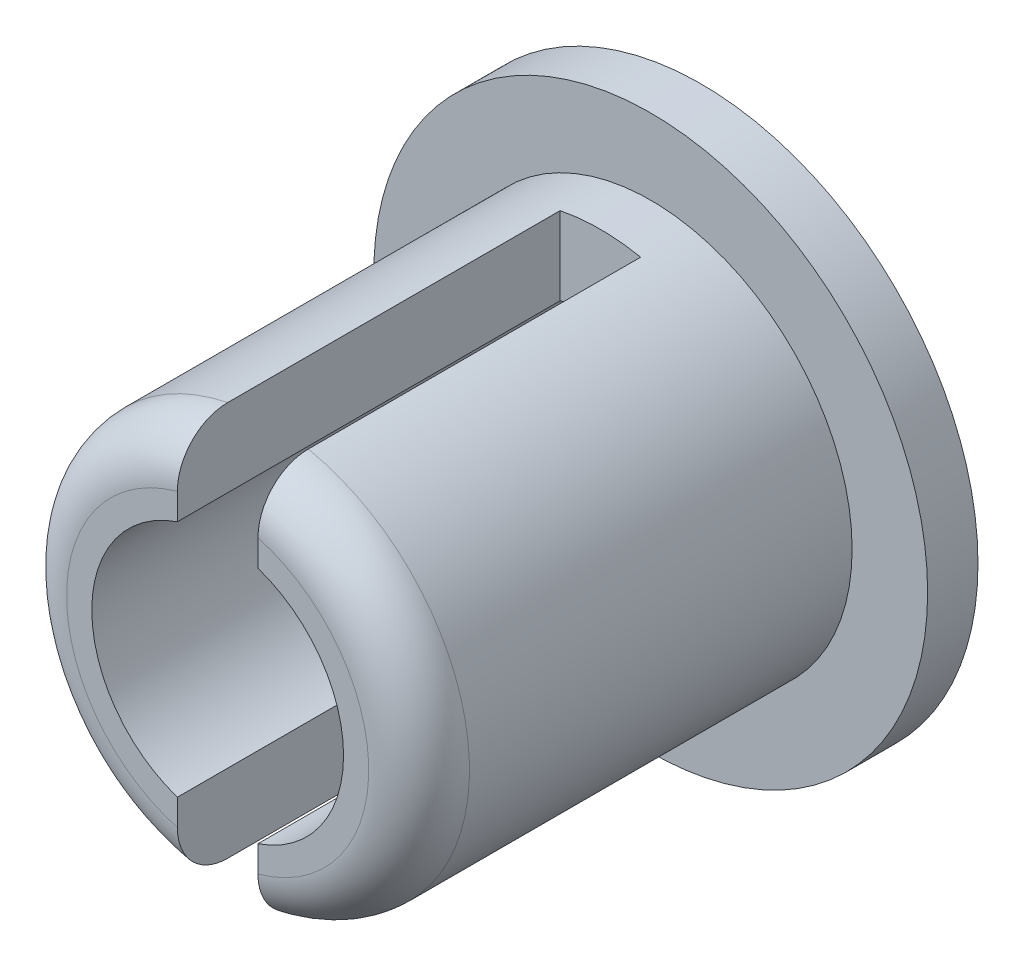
ISO-10303-21;
HEADER;
FILE_DESCRIPTION(('STEP AP214'),'2;1');
FILE_NAME('part.step','',(''),(''),'','','');
FILE_SCHEMA(('AUTOMOTIVE_DESIGN { 1 0 10303 214 1 1 1 1 }'));
ENDSEC;
DATA;
#1=APPLICATION_CONTEXT('core data for automotive mechanical design processes');
#2=APPLICATION_PROTOCOL_DEFINITION('international standard','automotive_design',2000,#1);
#3=PRODUCT_CONTEXT('',#1,'mechanical');
#4=PRODUCT('Part','Part','',(#3));
#5=PRODUCT_RELATED_PRODUCT_CATEGORY('part','',(#4));
#6=PRODUCT_DEFINITION_FORMATION('','',#4);
#7=PRODUCT_DEFINITION_CONTEXT('part definition',#1,'design');
#8=PRODUCT_DEFINITION('design','',#6,#7);
#9=PRODUCT_DEFINITION_SHAPE('','',#8);
#10=(LENGTH_UNIT() NAMED_UNIT(*) SI_UNIT(.MILLI.,.METRE.));
#11=(NAMED_UNIT(*) PLANE_ANGLE_UNIT() SI_UNIT($,.RADIAN.));
#12=(NAMED_UNIT(*) SI_UNIT($,.STERADIAN.) SOLID_ANGLE_UNIT());
#13=UNCERTAINTY_MEASURE_WITH_UNIT(LENGTH_MEASURE(1.E-05),#10,'distance_accuracy_value','');
#14=(GEOMETRIC_REPRESENTATION_CONTEXT(3) GLOBAL_UNCERTAINTY_ASSIGNED_CONTEXT((#13)) GLOBAL_UNIT_ASSIGNED_CONTEXT((#10,
#11,#12)) REPRESENTATION_CONTEXT('',''));
#15=CARTESIAN_POINT('',(0.,0.,0.));
#16=DIRECTION('',(0.,0.,1.));
#17=DIRECTION('',(1.,0.,0.));
#18=AXIS2_PLACEMENT_3D('',#15,#16,#17);
#19=CARTESIAN_POINT('',(0.,0.,1.));
#20=DIRECTION('',(0.,0.,1.));
#21=DIRECTION('',(1.,0.,0.));
#22=AXIS2_PLACEMENT_3D('',#19,#20,#21);
#23=PLANE('',#22);
#24=DIRECTION('',(0.,1.,0.));
#25=VECTOR('',#24,1.);
#26=CARTESIAN_POINT('',(0.4,0.,1.));
#27=LINE('',#26,#25);
#28=CARTESIAN_POINT('',(0.4,-1.95959179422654,1.));
#29=VERTEX_POINT('',#28);
#30=CARTESIAN_POINT('',(0.4,-1.1842719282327,1.));
#31=VERTEX_POINT('',#30);
#32=EDGE_CURVE('E161',#29,#31,#27,.T.);
#33=ORIENTED_EDGE('',*,*,#32,.T.);
#34=CARTESIAN_POINT('',(0.,0.,1.));
#35=DIRECTION('',(0.,0.,1.));
#36=DIRECTION('',(1.,0.,0.));
#37=AXIS2_PLACEMENT_3D('',#34,#35,#36);
#38=CIRCLE('',#37,1.25);
#39=CARTESIAN_POINT('',(-0.4,-1.1842719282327,1.));
#40=VERTEX_POINT('',#39);
#41=EDGE_CURVE('E198',#40,#31,#38,.T.);
#42=ORIENTED_EDGE('',*,*,#41,.F.);
#43=DIRECTION('',(0.,1.,0.));
#44=VECTOR('',#43,1.);
#45=CARTESIAN_POINT('',(-0.4,0.,1.));
#46=LINE('',#45,#44);
#47=CARTESIAN_POINT('',(-0.4,-1.95959179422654,1.));
#48=VERTEX_POINT('',#47);
#49=EDGE_CURVE('E171',#48,#40,#46,.T.);
#50=ORIENTED_EDGE('',*,*,#49,.F.);
#51=CARTESIAN_POINT('',(0.,0.,1.));
#52=DIRECTION('',(0.,0.,1.));
#53=DIRECTION('',(1.,0.,0.));
#54=AXIS2_PLACEMENT_3D('',#51,#52,#53);
#55=CIRCLE('',#54,2.);
#56=EDGE_CURVE('E202',#48,#29,#55,.T.);
#57=ORIENTED_EDGE('',*,*,#56,.T.);
#58=EDGE_LOOP('',(#33,#42,#50,#57));
#59=FACE_BOUND('',#58,.T.);
#60=ADVANCED_FACE('F45',(#59),#23,.T.);
#61=CARTESIAN_POINT('',(0.,0.,0.5));
#62=DIRECTION('',(0.,0.,1.));
#63=DIRECTION('',(1.,0.,0.));
#64=AXIS2_PLACEMENT_3D('',#61,#62,#63);
#65=PLANE('',#64);
#66=CARTESIAN_POINT('',(0.,0.,0.5));
#67=DIRECTION('',(0.,0.,1.));
#68=DIRECTION('',(1.,0.,0.));
#69=AXIS2_PLACEMENT_3D('',#66,#67,#68);
#70=CIRCLE('',#69,2.75);
#71=CARTESIAN_POINT('',(2.75,0.,0.5));
#72=VERTEX_POINT('',#71);
#73=EDGE_CURVE('E215',#72,#72,#70,.T.);
#74=ORIENTED_EDGE('',*,*,#73,.T.);
#75=EDGE_LOOP('',(#74));
#76=FACE_BOUND('',#75,.T.);
#77=CARTESIAN_POINT('',(0.,0.,0.5));
#78=DIRECTION('',(0.,0.,1.));
#79=DIRECTION('',(1.,0.,0.));
#80=AXIS2_PLACEMENT_3D('',#77,#78,#79);
#81=CIRCLE('',#80,2.);
#82=CARTESIAN_POINT('',(2.,0.,0.5));
#83=VERTEX_POINT('',#82);
#84=EDGE_CURVE('E201',#83,#83,#81,.T.);
#85=ORIENTED_EDGE('',*,*,#84,.F.);
#86=EDGE_LOOP('',(#85));
#87=FACE_BOUND('',#86,.T.);
#88=ADVANCED_FACE('F279',(#76,#87),#65,.T.);
#89=CARTESIAN_POINT('',(0.,0.,0.));
#90=DIRECTION('',(0.,0.,1.));
#91=DIRECTION('',(1.,0.,0.));
#92=AXIS2_PLACEMENT_3D('',#89,#90,#91);
#93=PLANE('',#92);
#94=CARTESIAN_POINT('',(0.,0.,0.));
#95=DIRECTION('',(0.,0.,1.));
#96=DIRECTION('',(1.,0.,0.));
#97=AXIS2_PLACEMENT_3D('',#94,#95,#96);
#98=CIRCLE('',#97,2.75);
#99=CARTESIAN_POINT('',(2.75,0.,0.));
#100=VERTEX_POINT('',#99);
#101=EDGE_CURVE('E214',#100,#100,#98,.T.);
#102=ORIENTED_EDGE('',*,*,#101,.F.);
#103=EDGE_LOOP('',(#102));
#104=FACE_BOUND('',#103,.T.);
#105=CARTESIAN_POINT('',(0.,0.,0.));
#106=DIRECTION('',(0.,0.,1.));
#107=DIRECTION('',(1.,0.,0.));
#108=AXIS2_PLACEMENT_3D('',#105,#106,#107);
#109=CIRCLE('',#108,1.25);
#110=CARTESIAN_POINT('',(1.25,0.,0.));
#111=VERTEX_POINT('',#110);
#112=EDGE_CURVE('E206',#111,#111,#109,.T.);
#113=ORIENTED_EDGE('',*,*,#112,.T.);
#114=EDGE_LOOP('',(#113));
#115=FACE_BOUND('',#114,.T.);
#116=ADVANCED_FACE('F281',(#104,#115),#93,.F.);
#117=CARTESIAN_POINT('',(0.,0.,0.5));
#118=DIRECTION('',(0.,0.,-1.));
#119=DIRECTION('',(-1.,0.,0.));
#120=AXIS2_PLACEMENT_3D('',#117,#118,#119);
#121=CYLINDRICAL_SURFACE('',#120,2.75);
#122=ORIENTED_EDGE('',*,*,#73,.F.);
#123=EDGE_LOOP('',(#122));
#124=FACE_BOUND('',#123,.T.);
#125=ORIENTED_EDGE('',*,*,#101,.T.);
#126=EDGE_LOOP('',(#125));
#127=FACE_BOUND('',#126,.T.);
#128=ADVANCED_FACE('F242',(#124,#127),#121,.T.);
#129=CARTESIAN_POINT('',(0.,0.,0.5));
#130=DIRECTION('',(0.,0.,-1.));
#131=DIRECTION('',(-1.,0.,0.));
#132=AXIS2_PLACEMENT_3D('',#129,#130,#131);
#133=CYLINDRICAL_SURFACE('',#132,1.25);
#134=ORIENTED_EDGE('',*,*,#112,.F.);
#135=EDGE_LOOP('',(#134));
#136=FACE_BOUND('',#135,.T.);
#137=ORIENTED_EDGE('',*,*,#41,.T.);
#138=DIRECTION('',(0.,0.,-1.));
#139=VECTOR('',#138,1.);
#140=CARTESIAN_POINT('',(0.4,-1.1842719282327,4.8));
#141=LINE('',#140,#139);
#142=CARTESIAN_POINT('',(0.4,-1.1842719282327,4.8));
#143=VERTEX_POINT('',#142);
#144=EDGE_CURVE('E140',#143,#31,#141,.T.);
#145=ORIENTED_EDGE('',*,*,#144,.F.);
#146=CARTESIAN_POINT('',(0.,0.,4.8));
#147=DIRECTION('',(0.,0.,1.));
#148=DIRECTION('',(1.,0.,0.));
#149=AXIS2_PLACEMENT_3D('',#146,#147,#148);
#150=CIRCLE('',#149,1.25);
#151=CARTESIAN_POINT('',(0.4,1.1842719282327,4.8));
#152=VERTEX_POINT('',#151);
#153=EDGE_CURVE('E144',#152,#143,#150,.F.);
#154=ORIENTED_EDGE('',*,*,#153,.F.);
#155=DIRECTION('',(0.,0.,-1.));
#156=VECTOR('',#155,1.);
#157=CARTESIAN_POINT('',(0.4,1.1842719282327,4.8));
#158=LINE('',#157,#156);
#159=CARTESIAN_POINT('',(0.4,1.1842719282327,1.));
#160=VERTEX_POINT('',#159);
#161=EDGE_CURVE('E130',#152,#160,#158,.T.);
#162=ORIENTED_EDGE('',*,*,#161,.T.);
#163=CARTESIAN_POINT('',(-0.4,1.1842719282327,1.));
#164=VERTEX_POINT('',#163);
#165=EDGE_CURVE('E197',#160,#164,#38,.T.);
#166=ORIENTED_EDGE('',*,*,#165,.T.);
#167=DIRECTION('',(0.,0.,-1.));
#168=VECTOR('',#167,1.);
#169=CARTESIAN_POINT('',(-0.4,1.1842719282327,4.8));
#170=LINE('',#169,#168);
#171=CARTESIAN_POINT('',(-0.4,1.1842719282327,4.8));
#172=VERTEX_POINT('',#171);
#173=EDGE_CURVE('E186',#172,#164,#170,.T.);
#174=ORIENTED_EDGE('',*,*,#173,.F.);
#175=CARTESIAN_POINT('',(0.,0.,4.8));
#176=DIRECTION('',(0.,0.,1.));
#177=DIRECTION('',(1.,0.,0.));
#178=AXIS2_PLACEMENT_3D('',#175,#176,#177);
#179=CIRCLE('',#178,1.25);
#180=CARTESIAN_POINT('',(-0.4,-1.1842719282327,4.8));
#181=VERTEX_POINT('',#180);
#182=EDGE_CURVE('E175',#181,#172,#179,.F.);
#183=ORIENTED_EDGE('',*,*,#182,.F.);
#184=DIRECTION('',(0.,0.,-1.));
#185=VECTOR('',#184,1.);
#186=CARTESIAN_POINT('',(-0.4,-1.1842719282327,4.8));
#187=LINE('',#186,#185);
#188=EDGE_CURVE('E190',#181,#40,#187,.T.);
#189=ORIENTED_EDGE('',*,*,#188,.T.);
#190=EDGE_LOOP('',(#137,#145,#154,#162,#166,#174,#183,#189));
#191=FACE_BOUND('',#190,.T.);
#192=ADVANCED_FACE('F146',(#136,#191),#133,.F.);
#193=CARTESIAN_POINT('',(0.4,1.95959179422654,1.));
#194=VERTEX_POINT('',#193);
#195=EDGE_CURVE('E136',#160,#194,#27,.T.);
#196=ORIENTED_EDGE('',*,*,#195,.T.);
#197=CARTESIAN_POINT('',(-0.4,1.95959179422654,1.));
#198=VERTEX_POINT('',#197);
#199=EDGE_CURVE('E207',#194,#198,#55,.T.);
#200=ORIENTED_EDGE('',*,*,#199,.T.);
#201=EDGE_CURVE('E176',#164,#198,#46,.T.);
#202=ORIENTED_EDGE('',*,*,#201,.F.);
#203=ORIENTED_EDGE('',*,*,#165,.F.);
#204=EDGE_LOOP('',(#196,#200,#202,#203));
#205=FACE_BOUND('',#204,.T.);
#206=ADVANCED_FACE('F267',(#205),#23,.T.);
#207=CARTESIAN_POINT('',(0.,0.,1.));
#208=DIRECTION('',(0.,0.,-1.));
#209=DIRECTION('',(-1.,0.,0.));
#210=AXIS2_PLACEMENT_3D('',#207,#208,#209);
#211=CYLINDRICAL_SURFACE('',#210,2.);
#212=DIRECTION('',(0.,0.,-1.));
#213=VECTOR('',#212,1.);
#214=CARTESIAN_POINT('',(0.4,1.95959179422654,4.8));
#215=LINE('',#214,#213);
#216=CARTESIAN_POINT('',(0.4,1.95959179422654,4.3));
#217=VERTEX_POINT('',#216);
#218=EDGE_CURVE('E139',#217,#194,#215,.T.);
#219=ORIENTED_EDGE('',*,*,#218,.F.);
#220=CARTESIAN_POINT('',(0.,0.,4.3));
#221=DIRECTION('',(0.,0.,1.));
#222=DIRECTION('',(1.,0.,0.));
#223=AXIS2_PLACEMENT_3D('',#220,#221,#222);
#224=CIRCLE('',#223,2.);
#225=CARTESIAN_POINT('',(0.4,-1.95959179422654,4.3));
#226=VERTEX_POINT('',#225);
#227=EDGE_CURVE('E254',#217,#226,#224,.F.);
#228=ORIENTED_EDGE('',*,*,#227,.T.);
#229=DIRECTION('',(0.,0.,-1.));
#230=VECTOR('',#229,1.);
#231=CARTESIAN_POINT('',(0.4,-1.95959179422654,4.8));
#232=LINE('',#231,#230);
#233=EDGE_CURVE('E168',#226,#29,#232,.T.);
#234=ORIENTED_EDGE('',*,*,#233,.T.);
#235=ORIENTED_EDGE('',*,*,#56,.F.);
#236=DIRECTION('',(0.,0.,-1.));
#237=VECTOR('',#236,1.);
#238=CARTESIAN_POINT('',(-0.4,-1.95959179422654,4.8));
#239=LINE('',#238,#237);
#240=CARTESIAN_POINT('',(-0.4,-1.95959179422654,4.3));
#241=VERTEX_POINT('',#240);
#242=EDGE_CURVE('E194',#241,#48,#239,.T.);
#243=ORIENTED_EDGE('',*,*,#242,.F.);
#244=CARTESIAN_POINT('',(0.,0.,4.3));
#245=DIRECTION('',(0.,0.,1.));
#246=DIRECTION('',(1.,0.,0.));
#247=AXIS2_PLACEMENT_3D('',#244,#245,#246);
#248=CIRCLE('',#247,2.);
#249=CARTESIAN_POINT('',(-0.4,1.95959179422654,4.3));
#250=VERTEX_POINT('',#249);
#251=EDGE_CURVE('E232',#241,#250,#248,.F.);
#252=ORIENTED_EDGE('',*,*,#251,.T.);
#253=DIRECTION('',(0.,0.,-1.));
#254=VECTOR('',#253,1.);
#255=CARTESIAN_POINT('',(-0.4,1.95959179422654,4.8));
#256=LINE('',#255,#254);
#257=EDGE_CURVE('E183',#250,#198,#256,.T.);
#258=ORIENTED_EDGE('',*,*,#257,.T.);
#259=ORIENTED_EDGE('',*,*,#199,.F.);
#260=EDGE_LOOP('',(#219,#228,#234,#235,#243,#252,#258,#259));
#261=FACE_BOUND('',#260,.T.);
#262=ORIENTED_EDGE('',*,*,#84,.T.);
#263=EDGE_LOOP('',(#262));
#264=FACE_BOUND('',#263,.T.);
#265=ADVANCED_FACE('F271',(#261,#264),#211,.T.);
#266=CARTESIAN_POINT('',(-0.4,0.,4.8));
#267=DIRECTION('',(-1.,0.,0.));
#268=DIRECTION('',(0.,0.,1.));
#269=AXIS2_PLACEMENT_3D('',#266,#267,#268);
#270=PLANE('',#269);
#271=DIRECTION('',(0.,1.,0.));
#272=VECTOR('',#271,1.);
#273=CARTESIAN_POINT('',(-0.4,0.,4.8));
#274=LINE('',#273,#272);
#275=CARTESIAN_POINT('',(-0.4,-1.4456832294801,4.8));
#276=VERTEX_POINT('',#275);
#277=EDGE_CURVE('E172',#276,#181,#274,.T.);
#278=ORIENTED_EDGE('',*,*,#277,.F.);
#279=CARTESIAN_POINT('',(-0.4,-1.4456832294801,4.8));
#280=CARTESIAN_POINT('',(-0.4,-1.47528801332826,4.80002441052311));
#281=CARTESIAN_POINT('',(-0.4,-1.50489955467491,4.79755864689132));
#282=CARTESIAN_POINT('',(-0.4,-1.56331658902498,4.78774767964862));
#283=CARTESIAN_POINT('',(-0.4,-1.59212168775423,4.78040013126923));
#284=CARTESIAN_POINT('',(-0.4,-1.64811048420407,4.7609147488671));
#285=CARTESIAN_POINT('',(-0.4,-1.67529215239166,4.74877105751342));
#286=CARTESIAN_POINT('',(-0.4,-1.72714766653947,4.71999378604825));
#287=CARTESIAN_POINT('',(-0.4,-1.7518230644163,4.70336300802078));
#288=CARTESIAN_POINT('',(-0.4,-1.79736545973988,4.66648055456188));
#289=CARTESIAN_POINT('',(-0.4,-1.81830698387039,4.64632093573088));
#290=CARTESIAN_POINT('',(-0.4,-1.8564047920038,4.60268261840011));
#291=CARTESIAN_POINT('',(-0.4,-1.87356037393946,4.57920330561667));
#292=CARTESIAN_POINT('',(-0.4,-1.90313644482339,4.5302523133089));
#293=CARTESIAN_POINT('',(-0.4,-1.91566659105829,4.50484676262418));
#294=CARTESIAN_POINT('',(-0.4,-1.93619090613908,4.45227663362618));
#295=CARTESIAN_POINT('',(-0.4,-1.94418924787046,4.42511369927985));
#296=CARTESIAN_POINT('',(-0.4,-1.95305410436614,4.3814419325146));
#297=CARTESIAN_POINT('',(-0.4,-1.95550468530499,4.36523856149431));
#298=CARTESIAN_POINT('',(-0.4,-1.95877284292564,4.3326926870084));
#299=CARTESIAN_POINT('',(-0.4,-1.95959287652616,4.31635043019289));
#300=CARTESIAN_POINT('',(-0.4,-1.95959179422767,4.30000000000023));
#301=B_SPLINE_CURVE_WITH_KNOTS('',3,(#279,#280,#281,#282,#283,#284,#285,#286,#287,#288,#289,
#290,#291,#292,#293,#294,#295,#296,#297,#298,#299,#300),.UNSPECIFIED.,.F.,.F.,(4,2,2,2,2,2,2,2,
2,2,4),(0.,0.0887224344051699,0.177487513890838,0.266361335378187,0.355179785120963,
0.441955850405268,0.528747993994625,0.613325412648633,0.697824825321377,0.746913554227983,
0.795928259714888),.UNSPECIFIED.);
#302=EDGE_CURVE('E60',#276,#241,#301,.T.);
#303=ORIENTED_EDGE('',*,*,#302,.T.);
#304=ORIENTED_EDGE('',*,*,#242,.T.);
#305=ORIENTED_EDGE('',*,*,#49,.T.);
#306=ORIENTED_EDGE('',*,*,#188,.F.);
#307=EDGE_LOOP('',(#278,#303,#304,#305,#306));
#308=FACE_BOUND('',#307,.T.);
#309=ADVANCED_FACE('F266',(#308),#270,.F.);
#310=ORIENTED_EDGE('',*,*,#257,.F.);
#311=CARTESIAN_POINT('',(-0.4,1.95959179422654,4.3));
#312=CARTESIAN_POINT('',(-0.4,1.95961744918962,4.32768545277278));
#313=CARTESIAN_POINT('',(-0.4,1.95724656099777,4.35536122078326));
#314=CARTESIAN_POINT('',(-0.4,1.94790396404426,4.40989039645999));
#315=CARTESIAN_POINT('',(-0.4,1.94093808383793,4.43674480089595));
#316=CARTESIAN_POINT('',(-0.4,1.92259388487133,4.48891077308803));
#317=CARTESIAN_POINT('',(-0.4,1.91121412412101,4.51422183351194));
#318=CARTESIAN_POINT('',(-0.4,1.88439885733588,4.56259116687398));
#319=CARTESIAN_POINT('',(-0.4,1.86896352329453,4.58564953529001));
#320=CARTESIAN_POINT('',(-0.4,1.83437071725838,4.62905479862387));
#321=CARTESIAN_POINT('',(-0.4,1.81518701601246,4.64938077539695));
#322=CARTESIAN_POINT('',(-0.4,1.77373475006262,4.68659843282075));
#323=CARTESIAN_POINT('',(-0.4,1.75146569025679,4.70348956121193));
#324=CARTESIAN_POINT('',(-0.4,1.70402602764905,4.73371560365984));
#325=CARTESIAN_POINT('',(-0.4,1.67880761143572,4.74697536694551));
#326=CARTESIAN_POINT('',(-0.4,1.62654280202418,4.76919659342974));
#327=CARTESIAN_POINT('',(-0.4,1.59949652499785,4.77815832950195));
#328=CARTESIAN_POINT('',(-0.4,1.55126231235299,4.78992197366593));
#329=CARTESIAN_POINT('',(-0.4,1.53030718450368,4.79370525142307));
#330=CARTESIAN_POINT('',(-0.4,1.48813025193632,4.79874430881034));
#331=CARTESIAN_POINT('',(-0.4,1.46690894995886,4.8000042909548));
#332=CARTESIAN_POINT('',(-0.4,1.4456832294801,4.8));
#333=B_SPLINE_CURVE_WITH_KNOTS('',3,(#311,#312,#313,#314,#315,#316,#317,#318,#319,#320,#321,
#322,#323,#324,#325,#326,#327,#328,#329,#330,#331,#332),.UNSPECIFIED.,.F.,.F.,(4,2,2,2,2,2,2,2,
2,2,4),(0.,0.0829406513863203,0.165776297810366,0.248639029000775,0.331498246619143,
0.414959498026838,0.498434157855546,0.583524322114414,0.668609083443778,0.732345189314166,
0.795975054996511),.UNSPECIFIED.);
#334=CARTESIAN_POINT('',(-0.4,1.4456832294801,4.8));
#335=VERTEX_POINT('',#334);
#336=EDGE_CURVE('E11',#250,#335,#333,.T.);
#337=ORIENTED_EDGE('',*,*,#336,.T.);
#338=EDGE_CURVE('E177',#172,#335,#274,.T.);
#339=ORIENTED_EDGE('',*,*,#338,.F.);
#340=ORIENTED_EDGE('',*,*,#173,.T.);
#341=ORIENTED_EDGE('',*,*,#201,.T.);
#342=EDGE_LOOP('',(#310,#337,#339,#340,#341));
#343=FACE_BOUND('',#342,.T.);
#344=ADVANCED_FACE('F261',(#343),#270,.F.);
#345=CARTESIAN_POINT('',(0.,0.,4.8));
#346=DIRECTION('',(0.,0.,1.));
#347=DIRECTION('',(1.,0.,0.));
#348=AXIS2_PLACEMENT_3D('',#345,#346,#347);
#349=PLANE('',#348);
#350=ORIENTED_EDGE('',*,*,#338,.T.);
#351=CARTESIAN_POINT('',(0.,0.,4.8));
#352=DIRECTION('',(0.,0.,1.));
#353=DIRECTION('',(1.,0.,0.));
#354=AXIS2_PLACEMENT_3D('',#351,#352,#353);
#355=CIRCLE('',#354,1.5);
#356=EDGE_CURVE('E253',#335,#276,#355,.T.);
#357=ORIENTED_EDGE('',*,*,#356,.T.);
#358=ORIENTED_EDGE('',*,*,#277,.T.);
#359=ORIENTED_EDGE('',*,*,#182,.T.);
#360=EDGE_LOOP('',(#350,#357,#358,#359));
#361=FACE_BOUND('',#360,.T.);
#362=ADVANCED_FACE('F265',(#361),#349,.T.);
#363=CARTESIAN_POINT('',(0.4,0.,4.8));
#364=DIRECTION('',(-1.,0.,0.));
#365=DIRECTION('',(0.,0.,1.));
#366=AXIS2_PLACEMENT_3D('',#363,#364,#365);
#367=PLANE('',#366);
#368=ORIENTED_EDGE('',*,*,#233,.F.);
#369=CARTESIAN_POINT('',(0.4,-1.95959179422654,4.3));
#370=CARTESIAN_POINT('',(0.4,-1.95961744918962,4.32768545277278));
#371=CARTESIAN_POINT('',(0.4,-1.95724656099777,4.35536122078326));
#372=CARTESIAN_POINT('',(0.4,-1.94790396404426,4.40989039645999));
#373=CARTESIAN_POINT('',(0.4,-1.94093808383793,4.43674480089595));
#374=CARTESIAN_POINT('',(0.4,-1.92259388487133,4.48891077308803));
#375=CARTESIAN_POINT('',(0.4,-1.91121412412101,4.51422183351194));
#376=CARTESIAN_POINT('',(0.4,-1.88439885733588,4.56259116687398));
#377=CARTESIAN_POINT('',(0.4,-1.86896352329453,4.58564953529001));
#378=CARTESIAN_POINT('',(0.4,-1.83437071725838,4.62905479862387));
#379=CARTESIAN_POINT('',(0.4,-1.81518701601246,4.64938077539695));
#380=CARTESIAN_POINT('',(0.4,-1.77373475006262,4.68659843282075));
#381=CARTESIAN_POINT('',(0.4,-1.75146569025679,4.70348956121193));
#382=CARTESIAN_POINT('',(0.4,-1.70402602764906,4.73371560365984));
#383=CARTESIAN_POINT('',(0.4,-1.67880761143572,4.7469753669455));
#384=CARTESIAN_POINT('',(0.4,-1.62654280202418,4.76919659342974));
#385=CARTESIAN_POINT('',(0.4,-1.59949652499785,4.77815832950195));
#386=CARTESIAN_POINT('',(0.4,-1.55126231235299,4.78992197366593));
#387=CARTESIAN_POINT('',(0.4,-1.53030718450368,4.79370525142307));
#388=CARTESIAN_POINT('',(0.4,-1.48813025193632,4.79874430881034));
#389=CARTESIAN_POINT('',(0.4,-1.46690894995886,4.8000042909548));
#390=CARTESIAN_POINT('',(0.4,-1.4456832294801,4.8));
#391=B_SPLINE_CURVE_WITH_KNOTS('',3,(#369,#370,#371,#372,#373,#374,#375,#376,#377,#378,#379,
#380,#381,#382,#383,#384,#385,#386,#387,#388,#389,#390),.UNSPECIFIED.,.F.,.F.,(4,2,2,2,2,2,2,2,
2,2,4),(0.,0.0829406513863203,0.165776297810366,0.248639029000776,0.331498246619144,
0.414959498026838,0.498434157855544,0.583524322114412,0.668609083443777,0.732345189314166,
0.795975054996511),.UNSPECIFIED.);
#392=CARTESIAN_POINT('',(0.4,-1.4456832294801,4.8));
#393=VERTEX_POINT('',#392);
#394=EDGE_CURVE('E246',#226,#393,#391,.T.);
#395=ORIENTED_EDGE('',*,*,#394,.T.);
#396=DIRECTION('',(0.,1.,0.));
#397=VECTOR('',#396,1.);
#398=CARTESIAN_POINT('',(0.4,0.,4.8));
#399=LINE('',#398,#397);
#400=EDGE_CURVE('E157',#393,#143,#399,.T.);
#401=ORIENTED_EDGE('',*,*,#400,.T.);
#402=ORIENTED_EDGE('',*,*,#144,.T.);
#403=ORIENTED_EDGE('',*,*,#32,.F.);
#404=EDGE_LOOP('',(#368,#395,#401,#402,#403));
#405=FACE_BOUND('',#404,.T.);
#406=ADVANCED_FACE('F302',(#405),#367,.T.);
#407=CARTESIAN_POINT('',(0.4,1.4456832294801,4.8));
#408=VERTEX_POINT('',#407);
#409=EDGE_CURVE('E134',#152,#408,#399,.T.);
#410=ORIENTED_EDGE('',*,*,#409,.T.);
#411=CARTESIAN_POINT('',(0.4,1.4456832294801,4.8));
#412=CARTESIAN_POINT('',(0.4,1.47528801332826,4.80002441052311));
#413=CARTESIAN_POINT('',(0.4,1.50489955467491,4.79755864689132));
#414=CARTESIAN_POINT('',(0.4,1.56331658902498,4.78774767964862));
#415=CARTESIAN_POINT('',(0.4,1.59212168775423,4.78040013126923));
#416=CARTESIAN_POINT('',(0.4,1.64811048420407,4.7609147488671));
#417=CARTESIAN_POINT('',(0.4,1.67529215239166,4.74877105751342));
#418=CARTESIAN_POINT('',(0.4,1.72714766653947,4.71999378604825));
#419=CARTESIAN_POINT('',(0.4,1.7518230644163,4.70336300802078));
#420=CARTESIAN_POINT('',(0.4,1.79736545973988,4.66648055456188));
#421=CARTESIAN_POINT('',(0.4,1.81830698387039,4.64632093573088));
#422=CARTESIAN_POINT('',(0.4,1.8564047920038,4.60268261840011));
#423=CARTESIAN_POINT('',(0.4,1.87356037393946,4.57920330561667));
#424=CARTESIAN_POINT('',(0.4,1.90313644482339,4.53025231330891));
#425=CARTESIAN_POINT('',(0.4,1.91566659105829,4.50484676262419));
#426=CARTESIAN_POINT('',(0.4,1.93619090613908,4.45227663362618));
#427=CARTESIAN_POINT('',(0.4,1.94418924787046,4.42511369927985));
#428=CARTESIAN_POINT('',(0.4,1.95305410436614,4.3814419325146));
#429=CARTESIAN_POINT('',(0.4,1.95550468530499,4.36523856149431));
#430=CARTESIAN_POINT('',(0.4,1.95877284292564,4.3326926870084));
#431=CARTESIAN_POINT('',(0.4,1.95959287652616,4.31635043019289));
#432=CARTESIAN_POINT('',(0.4,1.95959179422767,4.30000000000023));
#433=B_SPLINE_CURVE_WITH_KNOTS('',3,(#411,#412,#413,#414,#415,#416,#417,#418,#419,#420,#421,
#422,#423,#424,#425,#426,#427,#428,#429,#430,#431,#432),.UNSPECIFIED.,.F.,.F.,(4,2,2,2,2,2,2,2,
2,2,4),(0.,0.0887224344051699,0.177487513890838,0.266361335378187,0.355179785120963,
0.441955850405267,0.528747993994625,0.613325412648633,0.697824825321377,0.746913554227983,
0.795928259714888),.UNSPECIFIED.);
#434=EDGE_CURVE('E224',#408,#217,#433,.T.);
#435=ORIENTED_EDGE('',*,*,#434,.T.);
#436=ORIENTED_EDGE('',*,*,#218,.T.);
#437=ORIENTED_EDGE('',*,*,#195,.F.);
#438=ORIENTED_EDGE('',*,*,#161,.F.);
#439=EDGE_LOOP('',(#410,#435,#436,#437,#438));
#440=FACE_BOUND('',#439,.T.);
#441=ADVANCED_FACE('F132',(#440),#367,.T.);
#442=CARTESIAN_POINT('',(0.,0.,4.8));
#443=DIRECTION('',(0.,0.,1.));
#444=DIRECTION('',(1.,0.,0.));
#445=AXIS2_PLACEMENT_3D('',#442,#443,#444);
#446=PLANE('',#445);
#447=ORIENTED_EDGE('',*,*,#400,.F.);
#448=CARTESIAN_POINT('',(0.,0.,4.8));
#449=DIRECTION('',(0.,0.,1.));
#450=DIRECTION('',(1.,0.,0.));
#451=AXIS2_PLACEMENT_3D('',#448,#449,#450);
#452=CIRCLE('',#451,1.5);
#453=EDGE_CURVE('E155',#393,#408,#452,.T.);
#454=ORIENTED_EDGE('',*,*,#453,.T.);
#455=ORIENTED_EDGE('',*,*,#409,.F.);
#456=ORIENTED_EDGE('',*,*,#153,.T.);
#457=EDGE_LOOP('',(#447,#454,#455,#456));
#458=FACE_BOUND('',#457,.T.);
#459=ADVANCED_FACE('F153',(#458),#446,.T.);
#460=CARTESIAN_POINT('',(0.,0.,4.3));
#461=DIRECTION('',(0.,0.,1.));
#462=DIRECTION('',(1.,0.,0.));
#463=AXIS2_PLACEMENT_3D('',#460,#461,#462);
#464=TOROIDAL_SURFACE('',#463,1.5,0.5);
#465=ORIENTED_EDGE('',*,*,#394,.F.);
#466=ORIENTED_EDGE('',*,*,#227,.F.);
#467=ORIENTED_EDGE('',*,*,#434,.F.);
#468=ORIENTED_EDGE('',*,*,#453,.F.);
#469=EDGE_LOOP('',(#465,#466,#467,#468));
#470=FACE_BOUND('',#469,.T.);
#471=ADVANCED_FACE('F237',(#470),#464,.T.);
#472=CARTESIAN_POINT('',(0.,0.,4.3));
#473=DIRECTION('',(0.,0.,1.));
#474=DIRECTION('',(1.,0.,0.));
#475=AXIS2_PLACEMENT_3D('',#472,#473,#474);
#476=TOROIDAL_SURFACE('',#475,1.5,0.5);
#477=ORIENTED_EDGE('',*,*,#336,.F.);
#478=ORIENTED_EDGE('',*,*,#251,.F.);
#479=ORIENTED_EDGE('',*,*,#302,.F.);
#480=ORIENTED_EDGE('',*,*,#356,.F.);
#481=EDGE_LOOP('',(#477,#478,#479,#480));
#482=FACE_BOUND('',#481,.T.);
#483=ADVANCED_FACE('F47',(#482),#476,.T.);
#484=CLOSED_SHELL('',(#60,#88,#116,#128,#192,#206,#265,#309,#344,#362,#406,#441,#459,#471,#483));
#485=MANIFOLD_SOLID_BREP('B2',#484);
#486=ADVANCED_BREP_SHAPE_REPRESENTATION('',(#18,#485),#14);
#487=SHAPE_DEFINITION_REPRESENTATION(#9,#486);
ENDSEC;
END-ISO-10303-21;
